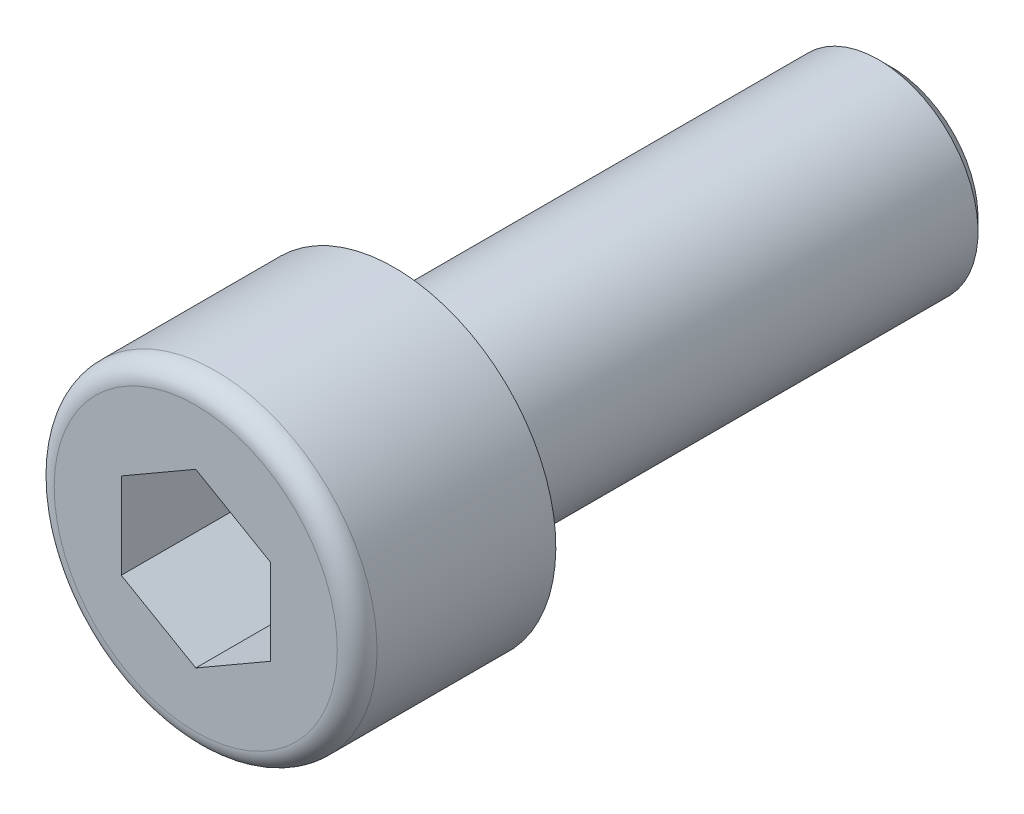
ISO-10303-21;
HEADER;
FILE_DESCRIPTION(('STEP AP214'),'2;1');
FILE_NAME('part.step','',(''),(''),'','','');
FILE_SCHEMA(('AUTOMOTIVE_DESIGN { 1 0 10303 214 1 1 1 1 }'));
ENDSEC;
DATA;
#1=APPLICATION_CONTEXT('core data for automotive mechanical design processes');
#2=APPLICATION_PROTOCOL_DEFINITION('international standard','automotive_design',2000,#1);
#3=PRODUCT_CONTEXT('',#1,'mechanical');
#4=PRODUCT('Part','Part','',(#3));
#5=PRODUCT_RELATED_PRODUCT_CATEGORY('part','',(#4));
#6=PRODUCT_DEFINITION_FORMATION('','',#4);
#7=PRODUCT_DEFINITION_CONTEXT('part definition',#1,'design');
#8=PRODUCT_DEFINITION('design','',#6,#7);
#9=PRODUCT_DEFINITION_SHAPE('','',#8);
#10=(LENGTH_UNIT() NAMED_UNIT(*) SI_UNIT(.MILLI.,.METRE.));
#11=(NAMED_UNIT(*) PLANE_ANGLE_UNIT() SI_UNIT($,.RADIAN.));
#12=(NAMED_UNIT(*) SI_UNIT($,.STERADIAN.) SOLID_ANGLE_UNIT());
#13=UNCERTAINTY_MEASURE_WITH_UNIT(LENGTH_MEASURE(1.E-05),#10,'distance_accuracy_value','');
#14=(GEOMETRIC_REPRESENTATION_CONTEXT(3) GLOBAL_UNCERTAINTY_ASSIGNED_CONTEXT((#13)) GLOBAL_UNIT_ASSIGNED_CONTEXT((#10,
#11,#12)) REPRESENTATION_CONTEXT('',''));
#15=CARTESIAN_POINT('',(0.,0.,0.));
#16=DIRECTION('',(0.,0.,1.));
#17=DIRECTION('',(1.,0.,0.));
#18=AXIS2_PLACEMENT_3D('',#15,#16,#17);
#19=CARTESIAN_POINT('',(0.,0.,0.));
#20=DIRECTION('',(0.,0.,1.));
#21=DIRECTION('',(0.795262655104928,-0.60626504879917,0.));
#22=AXIS2_PLACEMENT_3D('',#19,#20,#21);
#23=CYLINDRICAL_SURFACE('',#22,6.5);
#24=CARTESIAN_POINT('',(0.,0.,7.2));
#25=DIRECTION('',(0.,0.,-1.));
#26=DIRECTION('',(-1.,0.,0.));
#27=AXIS2_PLACEMENT_3D('',#24,#25,#26);
#28=CIRCLE('',#27,6.5);
#29=CARTESIAN_POINT('',(-6.5,0.,7.2));
#30=VERTEX_POINT('',#29);
#31=EDGE_CURVE('E22',#30,#30,#28,.T.);
#32=ORIENTED_EDGE('',*,*,#31,.T.);
#33=EDGE_LOOP('',(#32));
#34=FACE_BOUND('',#33,.T.);
#35=CARTESIAN_POINT('',(0.,0.,0.));
#36=DIRECTION('',(0.,0.,1.));
#37=DIRECTION('',(0.795262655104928,-0.60626504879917,0.));
#38=AXIS2_PLACEMENT_3D('',#35,#36,#37);
#39=CIRCLE('',#38,6.5);
#40=CARTESIAN_POINT('',(5.16920725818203,-3.9407228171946,0.));
#41=VERTEX_POINT('',#40);
#42=EDGE_CURVE('E124',#41,#41,#39,.F.);
#43=ORIENTED_EDGE('',*,*,#42,.F.);
#44=EDGE_LOOP('',(#43));
#45=FACE_BOUND('',#44,.T.);
#46=ADVANCED_FACE('F14',(#34,#45),#23,.T.);
#47=CARTESIAN_POINT('',(0.,0.,0.));
#48=DIRECTION('',(0.,0.,-1.));
#49=DIRECTION('',(-0.795262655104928,0.60626504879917,0.));
#50=AXIS2_PLACEMENT_3D('',#47,#48,#49);
#51=PLANE('',#50);
#52=CARTESIAN_POINT('',(0.,0.,0.));
#53=DIRECTION('',(0.,0.,-1.));
#54=DIRECTION('',(-0.795262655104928,0.60626504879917,0.));
#55=AXIS2_PLACEMENT_3D('',#52,#53,#54);
#56=CIRCLE('',#55,4.);
#57=CARTESIAN_POINT('',(-3.18105062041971,2.42506019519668,0.));
#58=VERTEX_POINT('',#57);
#59=EDGE_CURVE('E116',#58,#58,#56,.T.);
#60=ORIENTED_EDGE('',*,*,#59,.F.);
#61=EDGE_LOOP('',(#60));
#62=FACE_BOUND('',#61,.T.);
#63=ORIENTED_EDGE('',*,*,#42,.T.);
#64=EDGE_LOOP('',(#63));
#65=FACE_BOUND('',#64,.T.);
#66=ADVANCED_FACE('F153',(#62,#65),#51,.T.);
#67=CARTESIAN_POINT('',(0.,0.,-20.));
#68=DIRECTION('',(0.,0.,1.));
#69=DIRECTION('',(0.795262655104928,-0.60626504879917,0.));
#70=AXIS2_PLACEMENT_3D('',#67,#68,#69);
#71=CYLINDRICAL_SURFACE('',#70,4.);
#72=CARTESIAN_POINT('',(0.,0.,-19.5));
#73=DIRECTION('',(0.,0.,-1.));
#74=DIRECTION('',(-0.795262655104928,0.60626504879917,0.));
#75=AXIS2_PLACEMENT_3D('',#72,#73,#74);
#76=CIRCLE('',#75,4.);
#77=CARTESIAN_POINT('',(-3.18105062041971,2.42506019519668,-19.5));
#78=VERTEX_POINT('',#77);
#79=EDGE_CURVE('E130',#78,#78,#76,.F.);
#80=ORIENTED_EDGE('',*,*,#79,.T.);
#81=EDGE_LOOP('',(#80));
#82=FACE_BOUND('',#81,.T.);
#83=ORIENTED_EDGE('',*,*,#59,.T.);
#84=EDGE_LOOP('',(#83));
#85=FACE_BOUND('',#84,.T.);
#86=ADVANCED_FACE('F155',(#82,#85),#71,.T.);
#87=CARTESIAN_POINT('',(0.,0.,-20.));
#88=DIRECTION('',(0.,0.,-1.));
#89=DIRECTION('',(-0.795262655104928,0.60626504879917,0.));
#90=AXIS2_PLACEMENT_3D('',#87,#88,#89);
#91=PLANE('',#90);
#92=CARTESIAN_POINT('',(0.,0.,-20.));
#93=DIRECTION('',(0.,0.,-1.));
#94=DIRECTION('',(-0.795262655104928,0.60626504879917,0.));
#95=AXIS2_PLACEMENT_3D('',#92,#93,#94);
#96=CIRCLE('',#95,3.5);
#97=CARTESIAN_POINT('',(-2.78341929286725,2.1219276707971,-20.));
#98=VERTEX_POINT('',#97);
#99=EDGE_CURVE('E127',#98,#98,#96,.T.);
#100=ORIENTED_EDGE('',*,*,#99,.T.);
#101=EDGE_LOOP('',(#100));
#102=FACE_BOUND('',#101,.T.);
#103=ADVANCED_FACE('F163',(#102),#91,.T.);
#104=CARTESIAN_POINT('',(0.,0.,-20.));
#105=DIRECTION('',(0.,0.,1.));
#106=DIRECTION('',(0.795262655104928,-0.60626504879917,0.));
#107=AXIS2_PLACEMENT_3D('',#104,#105,#106);
#108=CONICAL_SURFACE('',#107,3.5,0.785398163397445);
#109=ORIENTED_EDGE('',*,*,#79,.F.);
#110=EDGE_LOOP('',(#109));
#111=FACE_BOUND('',#110,.T.);
#112=ORIENTED_EDGE('',*,*,#99,.F.);
#113=EDGE_LOOP('',(#112));
#114=FACE_BOUND('',#113,.T.);
#115=ADVANCED_FACE('F149',(#111,#114),#108,.T.);
#116=CARTESIAN_POINT('',(0.,0.,8.));
#117=DIRECTION('',(0.,0.,-1.));
#118=DIRECTION('',(-0.795262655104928,0.60626504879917,0.));
#119=AXIS2_PLACEMENT_3D('',#116,#117,#118);
#120=PLANE('',#119);
#121=DIRECTION('',(-0.866025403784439,-0.5,0.));
#122=VECTOR('',#121,1.);
#123=CARTESIAN_POINT('',(0.,3.46410161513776,8.));
#124=LINE('',#123,#122);
#125=CARTESIAN_POINT('',(0.,3.46410161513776,8.));
#126=VERTEX_POINT('',#125);
#127=CARTESIAN_POINT('',(-3.,1.73205080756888,8.));
#128=VERTEX_POINT('',#127);
#129=EDGE_CURVE('E103',#126,#128,#124,.T.);
#130=ORIENTED_EDGE('',*,*,#129,.F.);
#131=DIRECTION('',(-0.866025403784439,0.5,0.));
#132=VECTOR('',#131,1.);
#133=CARTESIAN_POINT('',(3.,1.73205080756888,8.));
#134=LINE('',#133,#132);
#135=CARTESIAN_POINT('',(3.,1.73205080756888,8.));
#136=VERTEX_POINT('',#135);
#137=EDGE_CURVE('E29',#136,#126,#134,.T.);
#138=ORIENTED_EDGE('',*,*,#137,.F.);
#139=DIRECTION('',(0.,1.,0.));
#140=VECTOR('',#139,1.);
#141=CARTESIAN_POINT('',(3.,-1.73205080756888,8.));
#142=LINE('',#141,#140);
#143=CARTESIAN_POINT('',(3.,-1.73205080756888,8.));
#144=VERTEX_POINT('',#143);
#145=EDGE_CURVE('E112',#144,#136,#142,.T.);
#146=ORIENTED_EDGE('',*,*,#145,.F.);
#147=DIRECTION('',(0.866025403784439,0.5,0.));
#148=VECTOR('',#147,1.);
#149=CARTESIAN_POINT('',(0.,-3.46410161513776,8.));
#150=LINE('',#149,#148);
#151=CARTESIAN_POINT('',(0.,-3.46410161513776,8.));
#152=VERTEX_POINT('',#151);
#153=EDGE_CURVE('E110',#152,#144,#150,.T.);
#154=ORIENTED_EDGE('',*,*,#153,.F.);
#155=DIRECTION('',(0.866025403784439,-0.5,0.));
#156=VECTOR('',#155,1.);
#157=CARTESIAN_POINT('',(-3.,-1.73205080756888,8.));
#158=LINE('',#157,#156);
#159=CARTESIAN_POINT('',(-3.,-1.73205080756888,8.));
#160=VERTEX_POINT('',#159);
#161=EDGE_CURVE('E77',#160,#152,#158,.T.);
#162=ORIENTED_EDGE('',*,*,#161,.F.);
#163=DIRECTION('',(0.,-1.,0.));
#164=VECTOR('',#163,1.);
#165=CARTESIAN_POINT('',(-3.,1.73205080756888,8.));
#166=LINE('',#165,#164);
#167=EDGE_CURVE('E106',#128,#160,#166,.T.);
#168=ORIENTED_EDGE('',*,*,#167,.F.);
#169=EDGE_LOOP('',(#130,#138,#146,#154,#162,#168));
#170=FACE_BOUND('',#169,.T.);
#171=CARTESIAN_POINT('',(0.,0.,8.));
#172=DIRECTION('',(0.,0.,-1.));
#173=DIRECTION('',(-1.,0.,0.));
#174=AXIS2_PLACEMENT_3D('',#171,#172,#173);
#175=CIRCLE('',#174,5.7);
#176=CARTESIAN_POINT('',(-5.7,0.,8.));
#177=VERTEX_POINT('',#176);
#178=EDGE_CURVE('E9',#177,#177,#175,.F.);
#179=ORIENTED_EDGE('',*,*,#178,.T.);
#180=EDGE_LOOP('',(#179));
#181=FACE_BOUND('',#180,.T.);
#182=ADVANCED_FACE('F139',(#170,#181),#120,.F.);
#183=CARTESIAN_POINT('',(0.,0.,7.2));
#184=DIRECTION('',(0.,0.,-1.));
#185=DIRECTION('',(-1.,0.,0.));
#186=AXIS2_PLACEMENT_3D('',#183,#184,#185);
#187=TOROIDAL_SURFACE('',#186,5.7,0.8);
#188=ORIENTED_EDGE('',*,*,#178,.F.);
#189=EDGE_LOOP('',(#188));
#190=FACE_BOUND('',#189,.T.);
#191=ORIENTED_EDGE('',*,*,#31,.F.);
#192=EDGE_LOOP('',(#191));
#193=FACE_BOUND('',#192,.T.);
#194=ADVANCED_FACE('F16',(#190,#193),#187,.T.);
#195=CARTESIAN_POINT('',(3.,1.73205080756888,3.));
#196=DIRECTION('',(0.5,0.866025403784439,0.));
#197=DIRECTION('',(-0.866025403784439,0.5,0.));
#198=AXIS2_PLACEMENT_3D('',#195,#196,#197);
#199=PLANE('',#198);
#200=ORIENTED_EDGE('',*,*,#137,.T.);
#201=DIRECTION('',(0.,0.,1.));
#202=VECTOR('',#201,1.);
#203=CARTESIAN_POINT('',(0.,3.46410161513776,3.));
#204=LINE('',#203,#202);
#205=CARTESIAN_POINT('',(0.,3.46410161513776,3.));
#206=VERTEX_POINT('',#205);
#207=EDGE_CURVE('E59',#206,#126,#204,.T.);
#208=ORIENTED_EDGE('',*,*,#207,.F.);
#209=DIRECTION('',(-0.866025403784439,0.5,0.));
#210=VECTOR('',#209,1.);
#211=CARTESIAN_POINT('',(3.,1.73205080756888,3.));
#212=LINE('',#211,#210);
#213=CARTESIAN_POINT('',(3.,1.73205080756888,3.));
#214=VERTEX_POINT('',#213);
#215=EDGE_CURVE('E114',#214,#206,#212,.T.);
#216=ORIENTED_EDGE('',*,*,#215,.F.);
#217=DIRECTION('',(0.,0.,1.));
#218=VECTOR('',#217,1.);
#219=CARTESIAN_POINT('',(3.,1.73205080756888,3.));
#220=LINE('',#219,#218);
#221=EDGE_CURVE('E37',#214,#136,#220,.T.);
#222=ORIENTED_EDGE('',*,*,#221,.T.);
#223=EDGE_LOOP('',(#200,#208,#216,#222));
#224=FACE_BOUND('',#223,.T.);
#225=ADVANCED_FACE('F138',(#224),#199,.F.);
#226=CARTESIAN_POINT('',(3.,-1.73205080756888,3.));
#227=DIRECTION('',(1.,0.,0.));
#228=DIRECTION('',(0.,0.,-1.));
#229=AXIS2_PLACEMENT_3D('',#226,#227,#228);
#230=PLANE('',#229);
#231=ORIENTED_EDGE('',*,*,#145,.T.);
#232=ORIENTED_EDGE('',*,*,#221,.F.);
#233=DIRECTION('',(0.,1.,0.));
#234=VECTOR('',#233,1.);
#235=CARTESIAN_POINT('',(3.,-1.73205080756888,3.));
#236=LINE('',#235,#234);
#237=CARTESIAN_POINT('',(3.,-1.73205080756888,3.));
#238=VERTEX_POINT('',#237);
#239=EDGE_CURVE('E89',#238,#214,#236,.T.);
#240=ORIENTED_EDGE('',*,*,#239,.F.);
#241=DIRECTION('',(0.,0.,1.));
#242=VECTOR('',#241,1.);
#243=CARTESIAN_POINT('',(3.,-1.73205080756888,3.));
#244=LINE('',#243,#242);
#245=EDGE_CURVE('E81',#238,#144,#244,.T.);
#246=ORIENTED_EDGE('',*,*,#245,.T.);
#247=EDGE_LOOP('',(#231,#232,#240,#246));
#248=FACE_BOUND('',#247,.T.);
#249=ADVANCED_FACE('F147',(#248),#230,.F.);
#250=CARTESIAN_POINT('',(0.,-3.46410161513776,3.));
#251=DIRECTION('',(0.5,-0.866025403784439,0.));
#252=DIRECTION('',(0.866025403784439,0.5,0.));
#253=AXIS2_PLACEMENT_3D('',#250,#251,#252);
#254=PLANE('',#253);
#255=ORIENTED_EDGE('',*,*,#153,.T.);
#256=ORIENTED_EDGE('',*,*,#245,.F.);
#257=DIRECTION('',(0.866025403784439,0.5,0.));
#258=VECTOR('',#257,1.);
#259=CARTESIAN_POINT('',(0.,-3.46410161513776,3.));
#260=LINE('',#259,#258);
#261=CARTESIAN_POINT('',(0.,-3.46410161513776,3.));
#262=VERTEX_POINT('',#261);
#263=EDGE_CURVE('E85',#262,#238,#260,.T.);
#264=ORIENTED_EDGE('',*,*,#263,.F.);
#265=DIRECTION('',(0.,0.,1.));
#266=VECTOR('',#265,1.);
#267=CARTESIAN_POINT('',(0.,-3.46410161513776,3.));
#268=LINE('',#267,#266);
#269=EDGE_CURVE('E70',#262,#152,#268,.T.);
#270=ORIENTED_EDGE('',*,*,#269,.T.);
#271=EDGE_LOOP('',(#255,#256,#264,#270));
#272=FACE_BOUND('',#271,.T.);
#273=ADVANCED_FACE('F86',(#272),#254,.F.);
#274=CARTESIAN_POINT('',(-3.,-1.73205080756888,3.));
#275=DIRECTION('',(-0.5,-0.866025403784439,0.));
#276=DIRECTION('',(0.866025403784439,-0.5,0.));
#277=AXIS2_PLACEMENT_3D('',#274,#275,#276);
#278=PLANE('',#277);
#279=ORIENTED_EDGE('',*,*,#161,.T.);
#280=ORIENTED_EDGE('',*,*,#269,.F.);
#281=DIRECTION('',(0.866025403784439,-0.5,0.));
#282=VECTOR('',#281,1.);
#283=CARTESIAN_POINT('',(-3.,-1.73205080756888,3.));
#284=LINE('',#283,#282);
#285=CARTESIAN_POINT('',(-3.,-1.73205080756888,3.));
#286=VERTEX_POINT('',#285);
#287=EDGE_CURVE('E74',#286,#262,#284,.T.);
#288=ORIENTED_EDGE('',*,*,#287,.F.);
#289=DIRECTION('',(0.,0.,1.));
#290=VECTOR('',#289,1.);
#291=CARTESIAN_POINT('',(-3.,-1.73205080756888,3.));
#292=LINE('',#291,#290);
#293=EDGE_CURVE('E82',#286,#160,#292,.T.);
#294=ORIENTED_EDGE('',*,*,#293,.T.);
#295=EDGE_LOOP('',(#279,#280,#288,#294));
#296=FACE_BOUND('',#295,.T.);
#297=ADVANCED_FACE('F72',(#296),#278,.F.);
#298=CARTESIAN_POINT('',(-3.,1.73205080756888,3.));
#299=DIRECTION('',(-1.,0.,0.));
#300=DIRECTION('',(0.,0.,1.));
#301=AXIS2_PLACEMENT_3D('',#298,#299,#300);
#302=PLANE('',#301);
#303=ORIENTED_EDGE('',*,*,#167,.T.);
#304=ORIENTED_EDGE('',*,*,#293,.F.);
#305=DIRECTION('',(0.,-1.,0.));
#306=VECTOR('',#305,1.);
#307=CARTESIAN_POINT('',(-3.,1.73205080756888,3.));
#308=LINE('',#307,#306);
#309=CARTESIAN_POINT('',(-3.,1.73205080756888,3.));
#310=VERTEX_POINT('',#309);
#311=EDGE_CURVE('E95',#310,#286,#308,.T.);
#312=ORIENTED_EDGE('',*,*,#311,.F.);
#313=DIRECTION('',(0.,0.,1.));
#314=VECTOR('',#313,1.);
#315=CARTESIAN_POINT('',(-3.,1.73205080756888,3.));
#316=LINE('',#315,#314);
#317=EDGE_CURVE('E119',#310,#128,#316,.T.);
#318=ORIENTED_EDGE('',*,*,#317,.T.);
#319=EDGE_LOOP('',(#303,#304,#312,#318));
#320=FACE_BOUND('',#319,.T.);
#321=ADVANCED_FACE('F188',(#320),#302,.F.);
#322=CARTESIAN_POINT('',(0.,3.46410161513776,3.));
#323=DIRECTION('',(-0.5,0.866025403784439,0.));
#324=DIRECTION('',(-0.866025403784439,-0.5,0.));
#325=AXIS2_PLACEMENT_3D('',#322,#323,#324);
#326=PLANE('',#325);
#327=ORIENTED_EDGE('',*,*,#129,.T.);
#328=ORIENTED_EDGE('',*,*,#317,.F.);
#329=DIRECTION('',(-0.866025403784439,-0.5,0.));
#330=VECTOR('',#329,1.);
#331=CARTESIAN_POINT('',(0.,3.46410161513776,3.));
#332=LINE('',#331,#330);
#333=EDGE_CURVE('E97',#206,#310,#332,.T.);
#334=ORIENTED_EDGE('',*,*,#333,.F.);
#335=ORIENTED_EDGE('',*,*,#207,.T.);
#336=EDGE_LOOP('',(#327,#328,#334,#335));
#337=FACE_BOUND('',#336,.T.);
#338=ADVANCED_FACE('F185',(#337),#326,.F.);
#339=CARTESIAN_POINT('',(0.,0.,3.));
#340=DIRECTION('',(0.,0.,1.));
#341=DIRECTION('',(1.,0.,0.));
#342=AXIS2_PLACEMENT_3D('',#339,#340,#341);
#343=PLANE('',#342);
#344=ORIENTED_EDGE('',*,*,#215,.T.);
#345=ORIENTED_EDGE('',*,*,#333,.T.);
#346=ORIENTED_EDGE('',*,*,#311,.T.);
#347=ORIENTED_EDGE('',*,*,#287,.T.);
#348=ORIENTED_EDGE('',*,*,#263,.T.);
#349=ORIENTED_EDGE('',*,*,#239,.T.);
#350=EDGE_LOOP('',(#344,#345,#346,#347,#348,#349));
#351=FACE_BOUND('',#350,.T.);
#352=ADVANCED_FACE('F92',(#351),#343,.T.);
#353=CLOSED_SHELL('',(#46,#66,#86,#103,#115,#182,#194,#225,#249,#273,#297,#321,#338,#352));
#354=MANIFOLD_SOLID_BREP('B1',#353);
#355=ADVANCED_BREP_SHAPE_REPRESENTATION('',(#18,#354),#14);
#356=SHAPE_DEFINITION_REPRESENTATION(#9,#355);
ENDSEC;
END-ISO-10303-21;
